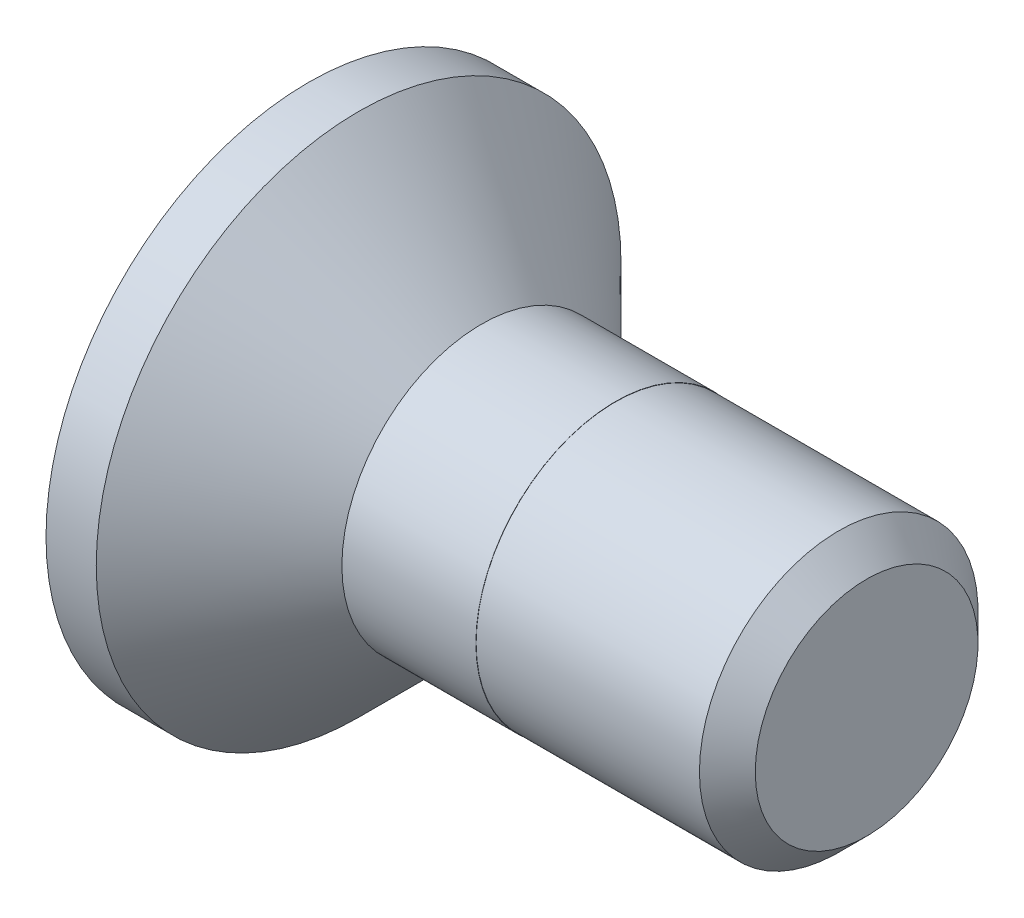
ISO-10303-21;
HEADER;
FILE_DESCRIPTION(('STEP AP214'),'2;1');
FILE_NAME('part.step','',(''),(''),'','','');
FILE_SCHEMA(('AUTOMOTIVE_DESIGN { 1 0 10303 214 1 1 1 1 }'));
ENDSEC;
DATA;
#1=APPLICATION_CONTEXT('core data for automotive mechanical design processes');
#2=APPLICATION_PROTOCOL_DEFINITION('international standard','automotive_design',2000,#1);
#3=PRODUCT_CONTEXT('',#1,'mechanical');
#4=PRODUCT('Part','Part','',(#3));
#5=PRODUCT_RELATED_PRODUCT_CATEGORY('part','',(#4));
#6=PRODUCT_DEFINITION_FORMATION('','',#4);
#7=PRODUCT_DEFINITION_CONTEXT('part definition',#1,'design');
#8=PRODUCT_DEFINITION('design','',#6,#7);
#9=PRODUCT_DEFINITION_SHAPE('','',#8);
#10=(LENGTH_UNIT() NAMED_UNIT(*) SI_UNIT(.MILLI.,.METRE.));
#11=(NAMED_UNIT(*) PLANE_ANGLE_UNIT() SI_UNIT($,.RADIAN.));
#12=(NAMED_UNIT(*) SI_UNIT($,.STERADIAN.) SOLID_ANGLE_UNIT());
#13=UNCERTAINTY_MEASURE_WITH_UNIT(LENGTH_MEASURE(1.E-05),#10,'distance_accuracy_value','');
#14=(GEOMETRIC_REPRESENTATION_CONTEXT(3) GLOBAL_UNCERTAINTY_ASSIGNED_CONTEXT((#13)) GLOBAL_UNIT_ASSIGNED_CONTEXT((#10,
#11,#12)) REPRESENTATION_CONTEXT('',''));
#15=CARTESIAN_POINT('',(0.,0.,0.));
#16=DIRECTION('',(0.,0.,1.));
#17=DIRECTION('',(1.,0.,0.));
#18=AXIS2_PLACEMENT_3D('',#15,#16,#17);
#19=CARTESIAN_POINT('',(0.,0.,0.));
#20=DIRECTION('',(-1.,0.,0.));
#21=DIRECTION('',(0.,0.,1.));
#22=AXIS2_PLACEMENT_3D('',#19,#20,#21);
#23=CYLINDRICAL_SURFACE('',#22,4.7);
#24=CARTESIAN_POINT('',(0.,0.,0.));
#25=DIRECTION('',(-1.,0.,0.));
#26=DIRECTION('',(0.,0.,1.));
#27=AXIS2_PLACEMENT_3D('',#24,#25,#26);
#28=CIRCLE('',#27,4.7);
#29=CARTESIAN_POINT('',(0.,0.,4.7));
#30=VERTEX_POINT('',#29);
#31=EDGE_CURVE('E146',#30,#30,#28,.T.);
#32=ORIENTED_EDGE('',*,*,#31,.F.);
#33=EDGE_LOOP('',(#32));
#34=FACE_BOUND('',#33,.T.);
#35=CARTESIAN_POINT('',(0.900000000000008,0.,0.));
#36=DIRECTION('',(-1.,0.,0.));
#37=DIRECTION('',(0.,0.,1.));
#38=AXIS2_PLACEMENT_3D('',#35,#36,#37);
#39=CIRCLE('',#38,4.7);
#40=CARTESIAN_POINT('',(0.900000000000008,0.,4.7));
#41=VERTEX_POINT('',#40);
#42=EDGE_CURVE('E182',#41,#41,#39,.T.);
#43=ORIENTED_EDGE('',*,*,#42,.T.);
#44=EDGE_LOOP('',(#43));
#45=FACE_BOUND('',#44,.T.);
#46=ADVANCED_FACE('F32',(#34,#45),#23,.T.);
#47=CARTESIAN_POINT('',(3.1,0.,0.));
#48=DIRECTION('',(-1.,0.,0.));
#49=DIRECTION('',(0.,0.,1.));
#50=AXIS2_PLACEMENT_3D('',#47,#48,#49);
#51=CONICAL_SURFACE('',#50,2.5,0.78539816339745);
#52=ORIENTED_EDGE('',*,*,#42,.F.);
#53=EDGE_LOOP('',(#52));
#54=FACE_BOUND('',#53,.T.);
#55=CARTESIAN_POINT('',(3.1,0.,0.));
#56=DIRECTION('',(-1.,0.,0.));
#57=DIRECTION('',(0.,0.,1.));
#58=AXIS2_PLACEMENT_3D('',#55,#56,#57);
#59=CIRCLE('',#58,2.5);
#60=CARTESIAN_POINT('',(3.1,0.,2.5));
#61=VERTEX_POINT('',#60);
#62=EDGE_CURVE('E179',#61,#61,#59,.T.);
#63=ORIENTED_EDGE('',*,*,#62,.T.);
#64=EDGE_LOOP('',(#63));
#65=FACE_BOUND('',#64,.T.);
#66=ADVANCED_FACE('F226',(#54,#65),#51,.T.);
#67=CARTESIAN_POINT('',(0.,0.,0.));
#68=DIRECTION('',(-1.,0.,0.));
#69=DIRECTION('',(0.,0.,1.));
#70=AXIS2_PLACEMENT_3D('',#67,#68,#69);
#71=CYLINDRICAL_SURFACE('',#70,2.5);
#72=ORIENTED_EDGE('',*,*,#62,.F.);
#73=EDGE_LOOP('',(#72));
#74=FACE_BOUND('',#73,.T.);
#75=CARTESIAN_POINT('',(5.5,0.,0.));
#76=DIRECTION('',(-1.,0.,0.));
#77=DIRECTION('',(0.,0.,1.));
#78=AXIS2_PLACEMENT_3D('',#75,#76,#77);
#79=CIRCLE('',#78,2.5);
#80=CARTESIAN_POINT('',(5.5,0.,2.5));
#81=VERTEX_POINT('',#80);
#82=EDGE_CURVE('E176',#81,#81,#79,.T.);
#83=ORIENTED_EDGE('',*,*,#82,.T.);
#84=EDGE_LOOP('',(#83));
#85=FACE_BOUND('',#84,.T.);
#86=ADVANCED_FACE('F231',(#74,#85),#71,.T.);
#87=CARTESIAN_POINT('',(5.5,2.5,0.));
#88=DIRECTION('',(-1.,0.,0.));
#89=DIRECTION('',(0.,0.,1.));
#90=AXIS2_PLACEMENT_3D('',#87,#88,#89);
#91=PLANE('',#90);
#92=ORIENTED_EDGE('',*,*,#82,.F.);
#93=EDGE_LOOP('',(#92));
#94=FACE_BOUND('',#93,.T.);
#95=CARTESIAN_POINT('',(5.5,0.,0.));
#96=DIRECTION('',(-1.,0.,0.));
#97=DIRECTION('',(0.,0.,1.));
#98=AXIS2_PLACEMENT_3D('',#95,#96,#97);
#99=CIRCLE('',#98,2.495);
#100=CARTESIAN_POINT('',(5.5,0.,2.495));
#101=VERTEX_POINT('',#100);
#102=EDGE_CURVE('E173',#101,#101,#99,.T.);
#103=ORIENTED_EDGE('',*,*,#102,.T.);
#104=EDGE_LOOP('',(#103));
#105=FACE_BOUND('',#104,.T.);
#106=ADVANCED_FACE('F241',(#94,#105),#91,.F.);
#107=CARTESIAN_POINT('',(0.,0.,0.));
#108=DIRECTION('',(-1.,0.,0.));
#109=DIRECTION('',(0.,0.,1.));
#110=AXIS2_PLACEMENT_3D('',#107,#108,#109);
#111=CYLINDRICAL_SURFACE('',#110,2.495);
#112=ORIENTED_EDGE('',*,*,#102,.F.);
#113=EDGE_LOOP('',(#112));
#114=FACE_BOUND('',#113,.T.);
#115=CARTESIAN_POINT('',(9.5,0.,0.));
#116=DIRECTION('',(-1.,0.,0.));
#117=DIRECTION('',(0.,0.,1.));
#118=AXIS2_PLACEMENT_3D('',#115,#116,#117);
#119=CIRCLE('',#118,2.495);
#120=CARTESIAN_POINT('',(9.5,0.,2.495));
#121=VERTEX_POINT('',#120);
#122=EDGE_CURVE('E170',#121,#121,#119,.T.);
#123=ORIENTED_EDGE('',*,*,#122,.T.);
#124=EDGE_LOOP('',(#123));
#125=FACE_BOUND('',#124,.T.);
#126=ADVANCED_FACE('F247',(#114,#125),#111,.T.);
#127=CARTESIAN_POINT('',(10.,0.,0.));
#128=DIRECTION('',(-1.,0.,0.));
#129=DIRECTION('',(0.,0.,1.));
#130=AXIS2_PLACEMENT_3D('',#127,#128,#129);
#131=CONICAL_SURFACE('',#130,1.995,0.78539816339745);
#132=ORIENTED_EDGE('',*,*,#122,.F.);
#133=EDGE_LOOP('',(#132));
#134=FACE_BOUND('',#133,.T.);
#135=CARTESIAN_POINT('',(10.,0.,0.));
#136=DIRECTION('',(-1.,0.,0.));
#137=DIRECTION('',(0.,0.,1.));
#138=AXIS2_PLACEMENT_3D('',#135,#136,#137);
#139=CIRCLE('',#138,1.995);
#140=CARTESIAN_POINT('',(10.,0.,1.995));
#141=VERTEX_POINT('',#140);
#142=EDGE_CURVE('E166',#141,#141,#139,.T.);
#143=ORIENTED_EDGE('',*,*,#142,.T.);
#144=EDGE_LOOP('',(#143));
#145=FACE_BOUND('',#144,.T.);
#146=ADVANCED_FACE('F253',(#134,#145),#131,.T.);
#147=CARTESIAN_POINT('',(10.,1.995,0.));
#148=DIRECTION('',(-1.,0.,0.));
#149=DIRECTION('',(0.,0.,1.));
#150=AXIS2_PLACEMENT_3D('',#147,#148,#149);
#151=PLANE('',#150);
#152=ORIENTED_EDGE('',*,*,#142,.F.);
#153=EDGE_LOOP('',(#152));
#154=FACE_BOUND('',#153,.T.);
#155=ADVANCED_FACE('F221',(#154),#151,.F.);
#156=CARTESIAN_POINT('',(0.,0.,0.));
#157=DIRECTION('',(-1.,0.,0.));
#158=DIRECTION('',(0.,0.,1.));
#159=AXIS2_PLACEMENT_3D('',#156,#157,#158);
#160=CONICAL_SURFACE('',#159,2.,1.03037682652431);
#161=CARTESIAN_POINT('',(0.160700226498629,1.5002,0.865909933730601));
#162=CARTESIAN_POINT('',(0.183625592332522,1.43405085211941,0.904101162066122));
#163=CARTESIAN_POINT('',(0.204484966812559,1.36728500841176,0.942648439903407));
#164=CARTESIAN_POINT('',(0.240886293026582,1.23250047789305,1.02046632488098));
#165=CARTESIAN_POINT('',(0.256414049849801,1.16447894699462,1.05973857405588));
#166=CARTESIAN_POINT('',(0.280505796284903,1.02934707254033,1.13775699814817));
#167=CARTESIAN_POINT('',(0.28924498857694,0.962261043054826,1.17648913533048));
#168=CARTESIAN_POINT('',(0.299575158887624,0.827755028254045,1.25414621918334));
#169=CARTESIAN_POINT('',(0.301175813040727,0.760335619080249,1.29307083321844));
#170=CARTESIAN_POINT('',(0.297373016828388,0.634924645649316,1.36547689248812));
#171=CARTESIAN_POINT('',(0.292901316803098,0.57690994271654,1.39897169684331));
#172=CARTESIAN_POINT('',(0.278885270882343,0.461290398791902,1.46572467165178));
#173=CARTESIAN_POINT('',(0.269335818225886,0.403686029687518,1.4989825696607));
#174=CARTESIAN_POINT('',(0.245522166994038,0.287815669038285,1.56588035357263));
#175=CARTESIAN_POINT('',(0.231151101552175,0.229566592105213,1.59951047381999));
#176=CARTESIAN_POINT('',(0.198589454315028,0.114000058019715,1.66623284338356));
#177=CARTESIAN_POINT('',(0.180407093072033,0.0566808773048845,1.699326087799));
#178=CARTESIAN_POINT('',(0.160700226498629,-0.000199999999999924,1.73216627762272));
#179=B_SPLINE_CURVE_WITH_KNOTS('',3,(#161,#162,#163,#164,#165,#166,#167,#168,#169,#170,#171,
#172,#173,#174,#175,#176,#177,#178),.UNSPECIFIED.,.F.,.F.,(4,2,2,2,2,2,2,2,4),(0.,
0.23935133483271,0.479335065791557,0.712897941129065,0.946144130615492,1.14735633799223,
1.34877129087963,1.55498299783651,1.76075442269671),.UNSPECIFIED.);
#180=CARTESIAN_POINT('',(0.160769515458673,1.5,0.866025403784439));
#181=VERTEX_POINT('',#180);
#182=CARTESIAN_POINT('',(0.160769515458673,0.,1.73205080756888));
#183=VERTEX_POINT('',#182);
#184=EDGE_CURVE('E185',#181,#183,#179,.T.);
#185=ORIENTED_EDGE('',*,*,#184,.T.);
#186=CARTESIAN_POINT('',(0.160700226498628,0.000200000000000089,1.73216627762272));
#187=CARTESIAN_POINT('',(0.183625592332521,-0.0659491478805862,1.6939750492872));
#188=CARTESIAN_POINT('',(0.204484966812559,-0.132714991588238,1.65542777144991));
#189=CARTESIAN_POINT('',(0.240886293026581,-0.267499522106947,1.57760988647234));
#190=CARTESIAN_POINT('',(0.256414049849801,-0.335521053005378,1.53833763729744));
#191=CARTESIAN_POINT('',(0.280505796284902,-0.470652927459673,1.46031921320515));
#192=CARTESIAN_POINT('',(0.289244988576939,-0.537738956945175,1.42158707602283));
#193=CARTESIAN_POINT('',(0.299575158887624,-0.672244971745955,1.34392999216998));
#194=CARTESIAN_POINT('',(0.301175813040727,-0.739664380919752,1.30500537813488));
#195=CARTESIAN_POINT('',(0.297373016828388,-0.865075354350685,1.2325993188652));
#196=CARTESIAN_POINT('',(0.292901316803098,-0.92309005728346,1.19910451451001));
#197=CARTESIAN_POINT('',(0.278885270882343,-1.0387096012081,1.13235153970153));
#198=CARTESIAN_POINT('',(0.269335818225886,-1.09631397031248,1.09909364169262));
#199=CARTESIAN_POINT('',(0.245522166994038,-1.21218433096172,1.03219585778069));
#200=CARTESIAN_POINT('',(0.231151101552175,-1.27043340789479,0.99856573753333));
#201=CARTESIAN_POINT('',(0.198589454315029,-1.38599994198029,0.931843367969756));
#202=CARTESIAN_POINT('',(0.180407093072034,-1.44331912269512,0.89875012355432));
#203=CARTESIAN_POINT('',(0.160700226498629,-1.5002,0.865909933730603));
#204=B_SPLINE_CURVE_WITH_KNOTS('',3,(#186,#187,#188,#189,#190,#191,#192,#193,#194,#195,#196,
#197,#198,#199,#200,#201,#202,#203),.UNSPECIFIED.,.F.,.F.,(4,2,2,2,2,2,2,2,4),(0.,
0.23935133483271,0.479335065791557,0.712897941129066,0.946144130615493,1.14735633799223,
1.34877129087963,1.55498299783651,1.76075442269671),.UNSPECIFIED.);
#205=CARTESIAN_POINT('',(0.160769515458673,-1.5,0.866025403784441));
#206=VERTEX_POINT('',#205);
#207=EDGE_CURVE('E11',#183,#206,#204,.T.);
#208=ORIENTED_EDGE('',*,*,#207,.T.);
#209=CARTESIAN_POINT('',(-0.45745973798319,-1.5,-2.31970590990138));
#210=CARTESIAN_POINT('',(-0.424612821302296,-1.5,-2.25449475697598));
#211=CARTESIAN_POINT('',(-0.392076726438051,-1.5,-2.18912430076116));
#212=CARTESIAN_POINT('',(-0.327801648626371,-1.5,-2.05797964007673));
#213=CARTESIAN_POINT('',(-0.296062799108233,-1.5,-1.99220537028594));
#214=CARTESIAN_POINT('',(-0.233385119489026,-1.5,-1.85980172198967));
#215=CARTESIAN_POINT('',(-0.20245208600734,-1.5,-1.7931695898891));
#216=CARTESIAN_POINT('',(-0.141839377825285,-1.5,-1.65933981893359));
#217=CARTESIAN_POINT('',(-0.112159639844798,-1.5,-1.59214220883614));
#218=CARTESIAN_POINT('',(-0.0533895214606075,-1.5,-1.45473392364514));
#219=CARTESIAN_POINT('',(-0.0243548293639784,-1.5,-1.38449929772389));
#220=CARTESIAN_POINT('',(0.0315259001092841,-1.5,-1.24314766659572));
#221=CARTESIAN_POINT('',(0.0583716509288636,-1.5,-1.17203054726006));
#222=CARTESIAN_POINT('',(0.109155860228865,-1.5,-1.0289373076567));
#223=CARTESIAN_POINT('',(0.133100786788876,-1.5,-0.956963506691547));
#224=CARTESIAN_POINT('',(0.177307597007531,-1.5,-0.811897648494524));
#225=CARTESIAN_POINT('',(0.197570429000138,-1.5,-0.738805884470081));
#226=CARTESIAN_POINT('',(0.233301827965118,-1.5,-0.591883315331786));
#227=CARTESIAN_POINT('',(0.248797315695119,-1.5,-0.518059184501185));
#228=CARTESIAN_POINT('',(0.274091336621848,-1.5,-0.369426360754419));
#229=CARTESIAN_POINT('',(0.283890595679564,-1.5,-0.294617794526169));
#230=CARTESIAN_POINT('',(0.296845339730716,-1.5,-0.145464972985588));
#231=CARTESIAN_POINT('',(0.30009182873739,-1.5,-0.0711288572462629));
#232=CARTESIAN_POINT('',(0.299904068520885,-1.5,0.0775341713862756));
#233=CARTESIAN_POINT('',(0.296469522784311,-1.5,0.151861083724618));
#234=CARTESIAN_POINT('',(0.280948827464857,-1.5,0.325486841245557));
#235=CARTESIAN_POINT('',(0.266286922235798,-1.5,0.424555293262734));
#236=CARTESIAN_POINT('',(0.227558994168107,-1.5,0.620835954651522));
#237=CARTESIAN_POINT('',(0.203484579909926,-1.5,0.718046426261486));
#238=CARTESIAN_POINT('',(0.147795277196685,-1.5,0.912610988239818));
#239=CARTESIAN_POINT('',(0.116022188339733,-1.5,1.00991861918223));
#240=CARTESIAN_POINT('',(0.0473792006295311,-1.5,1.20265488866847));
#241=CARTESIAN_POINT('',(0.0105105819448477,-1.5,1.29808399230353));
#242=CARTESIAN_POINT('',(-0.0817728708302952,-1.5,1.52415211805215));
#243=CARTESIAN_POINT('',(-0.138839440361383,-1.5,1.65411007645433));
#244=CARTESIAN_POINT('',(-0.257286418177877,-1.5,1.91205803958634));
#245=CARTESIAN_POINT('',(-0.318668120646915,-1.5,2.04004743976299));
#246=CARTESIAN_POINT('',(-0.444338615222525,-1.5,2.29476371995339));
#247=CARTESIAN_POINT('',(-0.508630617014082,-1.5,2.42148900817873));
#248=CARTESIAN_POINT('',(-0.639158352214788,-1.5,2.67393556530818));
#249=CARTESIAN_POINT('',(-0.705394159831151,-1.5,2.79965679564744));
#250=CARTESIAN_POINT('',(-0.833469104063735,-1.5,3.03954339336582));
#251=CARTESIAN_POINT('',(-0.895194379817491,-1.5,3.15376971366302));
#252=CARTESIAN_POINT('',(-1.0195134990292,-1.5,3.38175374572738));
#253=CARTESIAN_POINT('',(-1.08210737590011,-1.5,3.4955114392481));
#254=CARTESIAN_POINT('',(-1.2077848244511,-1.5,3.72234620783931));
#255=CARTESIAN_POINT('',(-1.27086657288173,-1.5,3.83542429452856));
#256=CARTESIAN_POINT('',(-1.39755082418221,-1.5,4.06127946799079));
#257=CARTESIAN_POINT('',(-1.46115329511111,-1.5,4.1740565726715));
#258=CARTESIAN_POINT('',(-1.52495068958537,-1.5,4.28672247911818));
#259=B_SPLINE_CURVE_WITH_KNOTS('',3,(#209,#210,#211,#212,#213,#214,#215,#216,#217,#218,#219,
#220,#221,#222,#223,#224,#225,#226,#227,#228,#229,#230,#231,#232,#233,#234,#235,#236,#237,#238,
#239,#240,#241,#242,#243,#244,#245,#246,#247,#248,#249,#250,#251,#252,#253,#254,#255,#256,#257,
#258),.UNSPECIFIED.,.F.,.F.,(4,2,2,2,2,2,2,2,2,2,2,2,2,2,2,2,2,2,2,2,2,2,2,2,4),(0.,
0.219052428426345,0.438141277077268,0.658517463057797,0.878882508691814,1.1068525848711,
1.33485245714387,1.56233420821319,1.78975728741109,2.01587150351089,2.24195689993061,
2.46488023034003,2.68781345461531,2.98764973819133,3.28775394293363,3.59464431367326,
3.90145772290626,4.32712672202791,4.75292393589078,5.17920277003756,5.60549789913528,
5.99500437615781,6.38452587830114,6.77297469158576,7.16139985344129),.UNSPECIFIED.);
#260=CARTESIAN_POINT('',(0.160769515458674,-1.5,-0.866025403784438));
#261=VERTEX_POINT('',#260);
#262=EDGE_CURVE('E44',#206,#261,#259,.F.);
#263=ORIENTED_EDGE('',*,*,#262,.T.);
#264=CARTESIAN_POINT('',(0.16070022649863,-1.5002,-0.8659099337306));
#265=CARTESIAN_POINT('',(0.183625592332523,-1.43405085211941,-0.904101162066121));
#266=CARTESIAN_POINT('',(0.20448496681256,-1.36728500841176,-0.942648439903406));
#267=CARTESIAN_POINT('',(0.240886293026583,-1.23250047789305,-1.02046632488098));
#268=CARTESIAN_POINT('',(0.256414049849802,-1.16447894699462,-1.05973857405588));
#269=CARTESIAN_POINT('',(0.280505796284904,-1.02934707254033,-1.13775699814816));
#270=CARTESIAN_POINT('',(0.289244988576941,-0.962261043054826,-1.17648913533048));
#271=CARTESIAN_POINT('',(0.299575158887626,-0.827755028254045,-1.25414621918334));
#272=CARTESIAN_POINT('',(0.301175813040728,-0.760335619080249,-1.29307083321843));
#273=CARTESIAN_POINT('',(0.297373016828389,-0.634924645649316,-1.36547689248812));
#274=CARTESIAN_POINT('',(0.2929013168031,-0.57690994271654,-1.39897169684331));
#275=CARTESIAN_POINT('',(0.278885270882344,-0.461290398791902,-1.46572467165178));
#276=CARTESIAN_POINT('',(0.269335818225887,-0.403686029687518,-1.4989825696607));
#277=CARTESIAN_POINT('',(0.24552216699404,-0.287815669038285,-1.56588035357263));
#278=CARTESIAN_POINT('',(0.231151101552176,-0.229566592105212,-1.59951047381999));
#279=CARTESIAN_POINT('',(0.198589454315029,-0.114000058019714,-1.66623284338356));
#280=CARTESIAN_POINT('',(0.180407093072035,-0.0566808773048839,-1.699326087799));
#281=CARTESIAN_POINT('',(0.16070022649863,0.000200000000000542,-1.73216627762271));
#282=B_SPLINE_CURVE_WITH_KNOTS('',3,(#264,#265,#266,#267,#268,#269,#270,#271,#272,#273,#274,
#275,#276,#277,#278,#279,#280,#281),.UNSPECIFIED.,.F.,.F.,(4,2,2,2,2,2,2,2,4),(0.,
0.23935133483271,0.479335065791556,0.712897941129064,0.946144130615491,1.14735633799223,
1.34877129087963,1.55498299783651,1.76075442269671),.UNSPECIFIED.);
#283=CARTESIAN_POINT('',(0.160769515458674,0.,-1.73205080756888));
#284=VERTEX_POINT('',#283);
#285=EDGE_CURVE('E299',#261,#284,#282,.T.);
#286=ORIENTED_EDGE('',*,*,#285,.T.);
#287=CARTESIAN_POINT('',(0.16070022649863,-0.000199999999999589,-1.73216627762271));
#288=CARTESIAN_POINT('',(0.183625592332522,0.0659491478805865,-1.69397504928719));
#289=CARTESIAN_POINT('',(0.20448496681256,0.132714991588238,-1.65542777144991));
#290=CARTESIAN_POINT('',(0.240886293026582,0.267499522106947,-1.57760988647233));
#291=CARTESIAN_POINT('',(0.256414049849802,0.335521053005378,-1.53833763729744));
#292=CARTESIAN_POINT('',(0.280505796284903,0.470652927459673,-1.46031921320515));
#293=CARTESIAN_POINT('',(0.289244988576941,0.537738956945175,-1.42158707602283));
#294=CARTESIAN_POINT('',(0.299575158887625,0.672244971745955,-1.34392999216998));
#295=CARTESIAN_POINT('',(0.301175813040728,0.739664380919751,-1.30500537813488));
#296=CARTESIAN_POINT('',(0.297373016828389,0.865075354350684,-1.2325993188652));
#297=CARTESIAN_POINT('',(0.292901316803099,0.92309005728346,-1.19910451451));
#298=CARTESIAN_POINT('',(0.278885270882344,1.0387096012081,-1.13235153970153));
#299=CARTESIAN_POINT('',(0.269335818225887,1.09631397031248,-1.09909364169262));
#300=CARTESIAN_POINT('',(0.245522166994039,1.21218433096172,-1.03219585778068));
#301=CARTESIAN_POINT('',(0.231151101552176,1.27043340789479,-0.998565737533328));
#302=CARTESIAN_POINT('',(0.198589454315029,1.38599994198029,-0.931843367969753));
#303=CARTESIAN_POINT('',(0.180407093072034,1.44331912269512,-0.898750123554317));
#304=CARTESIAN_POINT('',(0.16070022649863,1.5002,-0.8659099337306));
#305=B_SPLINE_CURVE_WITH_KNOTS('',3,(#287,#288,#289,#290,#291,#292,#293,#294,#295,#296,#297,
#298,#299,#300,#301,#302,#303,#304),.UNSPECIFIED.,.F.,.F.,(4,2,2,2,2,2,2,2,4),(0.,
0.23935133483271,0.479335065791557,0.712897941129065,0.946144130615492,1.14735633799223,
1.34877129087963,1.55498299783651,1.76075442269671),.UNSPECIFIED.);
#306=CARTESIAN_POINT('',(0.160769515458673,1.5,-0.866025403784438));
#307=VERTEX_POINT('',#306);
#308=EDGE_CURVE('E303',#284,#307,#305,.T.);
#309=ORIENTED_EDGE('',*,*,#308,.T.);
#310=CARTESIAN_POINT('',(-0.457459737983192,1.5,-2.31970590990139));
#311=CARTESIAN_POINT('',(-0.424612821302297,1.5,-2.25449475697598));
#312=CARTESIAN_POINT('',(-0.392076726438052,1.5,-2.18912430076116));
#313=CARTESIAN_POINT('',(-0.327801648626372,1.5,-2.05797964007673));
#314=CARTESIAN_POINT('',(-0.296062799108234,1.5,-1.99220537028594));
#315=CARTESIAN_POINT('',(-0.233385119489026,1.5,-1.85980172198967));
#316=CARTESIAN_POINT('',(-0.20245208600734,1.5,-1.7931695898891));
#317=CARTESIAN_POINT('',(-0.141839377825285,1.5,-1.65933981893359));
#318=CARTESIAN_POINT('',(-0.112159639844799,1.5,-1.59214220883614));
#319=CARTESIAN_POINT('',(-0.0533895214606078,1.5,-1.45473392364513));
#320=CARTESIAN_POINT('',(-0.0243548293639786,1.5,-1.38449929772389));
#321=CARTESIAN_POINT('',(0.0315259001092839,1.5,-1.24314766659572));
#322=CARTESIAN_POINT('',(0.0583716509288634,1.5,-1.17203054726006));
#323=CARTESIAN_POINT('',(0.109155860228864,1.5,-1.0289373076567));
#324=CARTESIAN_POINT('',(0.133100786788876,1.5,-0.956963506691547));
#325=CARTESIAN_POINT('',(0.17730759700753,1.5,-0.811897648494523));
#326=CARTESIAN_POINT('',(0.197570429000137,1.5,-0.73880588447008));
#327=CARTESIAN_POINT('',(0.233301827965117,1.5,-0.591883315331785));
#328=CARTESIAN_POINT('',(0.248797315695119,1.5,-0.518059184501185));
#329=CARTESIAN_POINT('',(0.274091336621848,1.5,-0.369426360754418));
#330=CARTESIAN_POINT('',(0.283890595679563,1.5,-0.294617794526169));
#331=CARTESIAN_POINT('',(0.296845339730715,1.5,-0.145464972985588));
#332=CARTESIAN_POINT('',(0.30009182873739,1.5,-0.0711288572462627));
#333=CARTESIAN_POINT('',(0.299904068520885,1.5,0.0775341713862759));
#334=CARTESIAN_POINT('',(0.296469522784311,1.5,0.151861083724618));
#335=CARTESIAN_POINT('',(0.280948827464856,1.5,0.325486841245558));
#336=CARTESIAN_POINT('',(0.266286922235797,1.5,0.424555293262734));
#337=CARTESIAN_POINT('',(0.227558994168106,1.5,0.620835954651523));
#338=CARTESIAN_POINT('',(0.203484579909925,1.5,0.718046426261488));
#339=CARTESIAN_POINT('',(0.147795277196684,1.5,0.912610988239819));
#340=CARTESIAN_POINT('',(0.116022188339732,1.5,1.00991861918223));
#341=CARTESIAN_POINT('',(0.0473792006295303,1.5,1.20265488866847));
#342=CARTESIAN_POINT('',(0.0105105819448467,1.5,1.29808399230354));
#343=CARTESIAN_POINT('',(-0.0817728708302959,1.5,1.52415211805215));
#344=CARTESIAN_POINT('',(-0.138839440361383,1.5,1.65411007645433));
#345=CARTESIAN_POINT('',(-0.257286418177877,1.5,1.91205803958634));
#346=CARTESIAN_POINT('',(-0.318668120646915,1.5,2.04004743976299));
#347=CARTESIAN_POINT('',(-0.444338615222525,1.5,2.29476371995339));
#348=CARTESIAN_POINT('',(-0.508630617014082,1.5,2.42148900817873));
#349=CARTESIAN_POINT('',(-0.639158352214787,1.5,2.67393556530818));
#350=CARTESIAN_POINT('',(-0.70539415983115,1.5,2.79965679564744));
#351=CARTESIAN_POINT('',(-0.833469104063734,1.5,3.03954339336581));
#352=CARTESIAN_POINT('',(-0.89519437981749,1.5,3.15376971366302));
#353=CARTESIAN_POINT('',(-1.0195134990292,1.5,3.38175374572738));
#354=CARTESIAN_POINT('',(-1.08210737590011,1.5,3.4955114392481));
#355=CARTESIAN_POINT('',(-1.2077848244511,1.5,3.72234620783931));
#356=CARTESIAN_POINT('',(-1.27086657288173,1.5,3.83542429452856));
#357=CARTESIAN_POINT('',(-1.39755082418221,1.5,4.06127946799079));
#358=CARTESIAN_POINT('',(-1.46115329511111,1.5,4.1740565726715));
#359=CARTESIAN_POINT('',(-1.52495068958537,1.5,4.28672247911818));
#360=B_SPLINE_CURVE_WITH_KNOTS('',3,(#310,#311,#312,#313,#314,#315,#316,#317,#318,#319,#320,
#321,#322,#323,#324,#325,#326,#327,#328,#329,#330,#331,#332,#333,#334,#335,#336,#337,#338,#339,
#340,#341,#342,#343,#344,#345,#346,#347,#348,#349,#350,#351,#352,#353,#354,#355,#356,#357,#358,
#359),.UNSPECIFIED.,.F.,.F.,(4,2,2,2,2,2,2,2,2,2,2,2,2,2,2,2,2,2,2,2,2,2,2,2,4),(0.,
0.219052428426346,0.438141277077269,0.658517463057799,0.878882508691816,1.10685258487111,
1.33485245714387,1.5623342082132,1.78975728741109,2.0158715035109,2.24195689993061,
2.46488023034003,2.68781345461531,2.98764973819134,3.28775394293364,3.59464431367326,
3.90145772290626,4.32712672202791,4.75292393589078,5.17920277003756,5.60549789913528,
5.99500437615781,6.38452587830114,6.77297469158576,7.16139985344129),.UNSPECIFIED.);
#361=EDGE_CURVE('E191',#307,#181,#360,.T.);
#362=ORIENTED_EDGE('',*,*,#361,.T.);
#363=EDGE_LOOP('',(#185,#208,#263,#286,#309,#362));
#364=FACE_BOUND('',#363,.T.);
#365=CARTESIAN_POINT('',(0.,0.,0.));
#366=DIRECTION('',(-1.,0.,0.));
#367=DIRECTION('',(0.,0.,1.));
#368=AXIS2_PLACEMENT_3D('',#365,#366,#367);
#369=CIRCLE('',#368,2.);
#370=CARTESIAN_POINT('',(0.,0.,2.));
#371=VERTEX_POINT('',#370);
#372=EDGE_CURVE('E160',#371,#371,#369,.T.);
#373=ORIENTED_EDGE('',*,*,#372,.T.);
#374=EDGE_LOOP('',(#373));
#375=FACE_BOUND('',#374,.T.);
#376=ADVANCED_FACE('F197',(#364,#375),#160,.F.);
#377=CARTESIAN_POINT('',(0.,2.,0.));
#378=DIRECTION('',(1.,0.,0.));
#379=DIRECTION('',(0.,0.,-1.));
#380=AXIS2_PLACEMENT_3D('',#377,#378,#379);
#381=PLANE('',#380);
#382=ORIENTED_EDGE('',*,*,#372,.F.);
#383=EDGE_LOOP('',(#382));
#384=FACE_BOUND('',#383,.T.);
#385=ORIENTED_EDGE('',*,*,#31,.T.);
#386=EDGE_LOOP('',(#385));
#387=FACE_BOUND('',#386,.T.);
#388=ADVANCED_FACE('F210',(#384,#387),#381,.F.);
#389=CARTESIAN_POINT('',(2.1,0.,1.73205080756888));
#390=DIRECTION('',(-1.,0.,0.));
#391=DIRECTION('',(0.,0.,1.));
#392=AXIS2_PLACEMENT_3D('',#389,#390,#391);
#393=PLANE('',#392);
#394=CARTESIAN_POINT('',(2.1,0.,0.));
#395=DIRECTION('',(-1.,0.,0.));
#396=DIRECTION('',(0.,0.,1.));
#397=AXIS2_PLACEMENT_3D('',#394,#395,#396);
#398=CIRCLE('',#397,1.5);
#399=CARTESIAN_POINT('',(2.1,-1.5,0.));
#400=VERTEX_POINT('',#399);
#401=CARTESIAN_POINT('',(2.1,-0.750000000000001,1.29903810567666));
#402=VERTEX_POINT('',#401);
#403=EDGE_CURVE('E287',#400,#402,#398,.T.);
#404=ORIENTED_EDGE('',*,*,#403,.F.);
#405=DIRECTION('',(0.,0.,1.));
#406=VECTOR('',#405,1.);
#407=CARTESIAN_POINT('',(2.1,-1.5,-0.866025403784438));
#408=LINE('',#407,#406);
#409=CARTESIAN_POINT('',(2.1,-1.5,0.866025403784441));
#410=VERTEX_POINT('',#409);
#411=EDGE_CURVE('E141',#400,#410,#408,.T.);
#412=ORIENTED_EDGE('',*,*,#411,.T.);
#413=DIRECTION('',(0.,0.866025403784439,0.5));
#414=VECTOR('',#413,1.);
#415=CARTESIAN_POINT('',(2.1,-1.5,0.866025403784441));
#416=LINE('',#415,#414);
#417=EDGE_CURVE('E114',#410,#402,#416,.T.);
#418=ORIENTED_EDGE('',*,*,#417,.T.);
#419=EDGE_LOOP('',(#404,#412,#418));
#420=FACE_BOUND('',#419,.T.);
#421=ADVANCED_FACE('F212',(#420),#393,.T.);
#422=CARTESIAN_POINT('',(2.1,-0.75,-1.29903810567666));
#423=VERTEX_POINT('',#422);
#424=EDGE_CURVE('E285',#423,#400,#398,.T.);
#425=ORIENTED_EDGE('',*,*,#424,.F.);
#426=DIRECTION('',(0.,-0.866025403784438,0.5));
#427=VECTOR('',#426,1.);
#428=CARTESIAN_POINT('',(2.1,0.,-1.73205080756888));
#429=LINE('',#428,#427);
#430=CARTESIAN_POINT('',(2.1,-1.5,-0.866025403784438));
#431=VERTEX_POINT('',#430);
#432=EDGE_CURVE('E137',#423,#431,#429,.T.);
#433=ORIENTED_EDGE('',*,*,#432,.T.);
#434=EDGE_CURVE('E121',#431,#400,#408,.T.);
#435=ORIENTED_EDGE('',*,*,#434,.T.);
#436=EDGE_LOOP('',(#425,#433,#435));
#437=FACE_BOUND('',#436,.T.);
#438=ADVANCED_FACE('F218',(#437),#393,.T.);
#439=CARTESIAN_POINT('',(2.1,0.75,-1.29903810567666));
#440=VERTEX_POINT('',#439);
#441=EDGE_CURVE('E284',#440,#423,#398,.T.);
#442=ORIENTED_EDGE('',*,*,#441,.F.);
#443=DIRECTION('',(0.,-0.866025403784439,-0.5));
#444=VECTOR('',#443,1.);
#445=CARTESIAN_POINT('',(2.1,1.5,-0.866025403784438));
#446=LINE('',#445,#444);
#447=CARTESIAN_POINT('',(2.1,0.,-1.73205080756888));
#448=VERTEX_POINT('',#447);
#449=EDGE_CURVE('E133',#440,#448,#446,.T.);
#450=ORIENTED_EDGE('',*,*,#449,.T.);
#451=EDGE_CURVE('E138',#448,#423,#429,.T.);
#452=ORIENTED_EDGE('',*,*,#451,.T.);
#453=EDGE_LOOP('',(#442,#450,#452));
#454=FACE_BOUND('',#453,.T.);
#455=ADVANCED_FACE('F327',(#454),#393,.T.);
#456=CARTESIAN_POINT('',(2.1,1.5,0.));
#457=VERTEX_POINT('',#456);
#458=EDGE_CURVE('E167',#457,#440,#398,.T.);
#459=ORIENTED_EDGE('',*,*,#458,.F.);
#460=DIRECTION('',(0.,0.,-1.));
#461=VECTOR('',#460,1.);
#462=CARTESIAN_POINT('',(2.1,1.5,0.866025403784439));
#463=LINE('',#462,#461);
#464=CARTESIAN_POINT('',(2.1,1.5,-0.866025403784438));
#465=VERTEX_POINT('',#464);
#466=EDGE_CURVE('E127',#457,#465,#463,.T.);
#467=ORIENTED_EDGE('',*,*,#466,.T.);
#468=EDGE_CURVE('E134',#465,#440,#446,.T.);
#469=ORIENTED_EDGE('',*,*,#468,.T.);
#470=EDGE_LOOP('',(#459,#467,#469));
#471=FACE_BOUND('',#470,.T.);
#472=ADVANCED_FACE('F283',(#471),#393,.T.);
#473=CARTESIAN_POINT('',(2.1,0.75,1.29903810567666));
#474=VERTEX_POINT('',#473);
#475=EDGE_CURVE('E163',#474,#457,#398,.T.);
#476=ORIENTED_EDGE('',*,*,#475,.F.);
#477=DIRECTION('',(0.,0.866025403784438,-0.5));
#478=VECTOR('',#477,1.);
#479=CARTESIAN_POINT('',(2.1,0.,1.73205080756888));
#480=LINE('',#479,#478);
#481=CARTESIAN_POINT('',(2.1,1.5,0.866025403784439));
#482=VERTEX_POINT('',#481);
#483=EDGE_CURVE('E125',#474,#482,#480,.T.);
#484=ORIENTED_EDGE('',*,*,#483,.T.);
#485=EDGE_CURVE('E129',#482,#457,#463,.T.);
#486=ORIENTED_EDGE('',*,*,#485,.T.);
#487=EDGE_LOOP('',(#476,#484,#486));
#488=FACE_BOUND('',#487,.T.);
#489=ADVANCED_FACE('F275',(#488),#393,.T.);
#490=EDGE_CURVE('E111',#402,#474,#398,.T.);
#491=ORIENTED_EDGE('',*,*,#490,.F.);
#492=CARTESIAN_POINT('',(2.1,0.,1.73205080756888));
#493=VERTEX_POINT('',#492);
#494=EDGE_CURVE('E108',#402,#493,#416,.T.);
#495=ORIENTED_EDGE('',*,*,#494,.T.);
#496=EDGE_CURVE('E51',#493,#474,#480,.T.);
#497=ORIENTED_EDGE('',*,*,#496,.T.);
#498=EDGE_LOOP('',(#491,#495,#497));
#499=FACE_BOUND('',#498,.T.);
#500=ADVANCED_FACE('F109',(#499),#393,.T.);
#501=CARTESIAN_POINT('',(2.1,-1.5,0.866025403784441));
#502=DIRECTION('',(0.,-0.5,0.866025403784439));
#503=DIRECTION('',(0.,-0.866025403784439,-0.5));
#504=AXIS2_PLACEMENT_3D('',#501,#502,#503);
#505=PLANE('',#504);
#506=ORIENTED_EDGE('',*,*,#207,.F.);
#507=DIRECTION('',(-1.,0.,0.));
#508=VECTOR('',#507,1.);
#509=CARTESIAN_POINT('',(2.1,0.,1.73205080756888));
#510=LINE('',#509,#508);
#511=EDGE_CURVE('E116',#493,#183,#510,.T.);
#512=ORIENTED_EDGE('',*,*,#511,.F.);
#513=ORIENTED_EDGE('',*,*,#494,.F.);
#514=ORIENTED_EDGE('',*,*,#417,.F.);
#515=DIRECTION('',(-1.,0.,0.));
#516=VECTOR('',#515,1.);
#517=CARTESIAN_POINT('',(2.1,-1.5,0.866025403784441));
#518=LINE('',#517,#516);
#519=EDGE_CURVE('E144',#410,#206,#518,.T.);
#520=ORIENTED_EDGE('',*,*,#519,.T.);
#521=EDGE_LOOP('',(#506,#512,#513,#514,#520));
#522=FACE_BOUND('',#521,.T.);
#523=ADVANCED_FACE('F117',(#522),#505,.F.);
#524=CARTESIAN_POINT('',(2.1,-1.5,-0.866025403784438));
#525=DIRECTION('',(0.,-1.,0.));
#526=DIRECTION('',(0.,0.,-1.));
#527=AXIS2_PLACEMENT_3D('',#524,#525,#526);
#528=PLANE('',#527);
#529=ORIENTED_EDGE('',*,*,#262,.F.);
#530=ORIENTED_EDGE('',*,*,#519,.F.);
#531=ORIENTED_EDGE('',*,*,#411,.F.);
#532=ORIENTED_EDGE('',*,*,#434,.F.);
#533=DIRECTION('',(-1.,0.,0.));
#534=VECTOR('',#533,1.);
#535=CARTESIAN_POINT('',(2.1,-1.5,-0.866025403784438));
#536=LINE('',#535,#534);
#537=EDGE_CURVE('E147',#431,#261,#536,.T.);
#538=ORIENTED_EDGE('',*,*,#537,.T.);
#539=EDGE_LOOP('',(#529,#530,#531,#532,#538));
#540=FACE_BOUND('',#539,.T.);
#541=ADVANCED_FACE('F209',(#540),#528,.F.);
#542=CARTESIAN_POINT('',(2.1,0.,-1.73205080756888));
#543=DIRECTION('',(0.,-0.5,-0.866025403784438));
#544=DIRECTION('',(0.,0.866025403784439,-0.5));
#545=AXIS2_PLACEMENT_3D('',#542,#543,#544);
#546=PLANE('',#545);
#547=ORIENTED_EDGE('',*,*,#285,.F.);
#548=ORIENTED_EDGE('',*,*,#537,.F.);
#549=ORIENTED_EDGE('',*,*,#432,.F.);
#550=ORIENTED_EDGE('',*,*,#451,.F.);
#551=DIRECTION('',(-1.,0.,0.));
#552=VECTOR('',#551,1.);
#553=CARTESIAN_POINT('',(2.1,0.,-1.73205080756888));
#554=LINE('',#553,#552);
#555=EDGE_CURVE('E150',#448,#284,#554,.T.);
#556=ORIENTED_EDGE('',*,*,#555,.T.);
#557=EDGE_LOOP('',(#547,#548,#549,#550,#556));
#558=FACE_BOUND('',#557,.T.);
#559=ADVANCED_FACE('F297',(#558),#546,.F.);
#560=CARTESIAN_POINT('',(2.1,1.5,-0.866025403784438));
#561=DIRECTION('',(0.,0.5,-0.866025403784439));
#562=DIRECTION('',(0.,0.866025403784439,0.5));
#563=AXIS2_PLACEMENT_3D('',#560,#561,#562);
#564=PLANE('',#563);
#565=ORIENTED_EDGE('',*,*,#308,.F.);
#566=ORIENTED_EDGE('',*,*,#555,.F.);
#567=ORIENTED_EDGE('',*,*,#449,.F.);
#568=ORIENTED_EDGE('',*,*,#468,.F.);
#569=DIRECTION('',(-1.,0.,0.));
#570=VECTOR('',#569,1.);
#571=CARTESIAN_POINT('',(2.1,1.5,-0.866025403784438));
#572=LINE('',#571,#570);
#573=EDGE_CURVE('E153',#465,#307,#572,.T.);
#574=ORIENTED_EDGE('',*,*,#573,.T.);
#575=EDGE_LOOP('',(#565,#566,#567,#568,#574));
#576=FACE_BOUND('',#575,.T.);
#577=ADVANCED_FACE('F317',(#576),#564,.F.);
#578=CARTESIAN_POINT('',(2.1,1.5,0.866025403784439));
#579=DIRECTION('',(0.,1.,0.));
#580=DIRECTION('',(0.,0.,1.));
#581=AXIS2_PLACEMENT_3D('',#578,#579,#580);
#582=PLANE('',#581);
#583=ORIENTED_EDGE('',*,*,#361,.F.);
#584=ORIENTED_EDGE('',*,*,#573,.F.);
#585=ORIENTED_EDGE('',*,*,#466,.F.);
#586=ORIENTED_EDGE('',*,*,#485,.F.);
#587=DIRECTION('',(-1.,0.,0.));
#588=VECTOR('',#587,1.);
#589=CARTESIAN_POINT('',(2.1,1.5,0.866025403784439));
#590=LINE('',#589,#588);
#591=EDGE_CURVE('E120',#482,#181,#590,.T.);
#592=ORIENTED_EDGE('',*,*,#591,.T.);
#593=EDGE_LOOP('',(#583,#584,#585,#586,#592));
#594=FACE_BOUND('',#593,.T.);
#595=ADVANCED_FACE('F204',(#594),#582,.F.);
#596=CARTESIAN_POINT('',(2.1,0.,1.73205080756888));
#597=DIRECTION('',(0.,0.5,0.866025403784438));
#598=DIRECTION('',(0.,-0.866025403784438,0.5));
#599=AXIS2_PLACEMENT_3D('',#596,#597,#598);
#600=PLANE('',#599);
#601=ORIENTED_EDGE('',*,*,#184,.F.);
#602=ORIENTED_EDGE('',*,*,#591,.F.);
#603=ORIENTED_EDGE('',*,*,#483,.F.);
#604=ORIENTED_EDGE('',*,*,#496,.F.);
#605=ORIENTED_EDGE('',*,*,#511,.T.);
#606=EDGE_LOOP('',(#601,#602,#603,#604,#605));
#607=FACE_BOUND('',#606,.T.);
#608=ADVANCED_FACE('F123',(#607),#600,.F.);
#609=CARTESIAN_POINT('',(2.1,0.,0.));
#610=DIRECTION('',(-1.,0.,0.));
#611=DIRECTION('',(0.,0.,1.));
#612=AXIS2_PLACEMENT_3D('',#609,#610,#611);
#613=CONICAL_SURFACE('',#612,1.5,1.04719755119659);
#614=CARTESIAN_POINT('',(2.96602540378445,0.,0.));
#615=VERTEX_POINT('',#614);
#616=VERTEX_LOOP('',#615);
#617=FACE_BOUND('',#616,.T.);
#618=ORIENTED_EDGE('',*,*,#475,.T.);
#619=ORIENTED_EDGE('',*,*,#458,.T.);
#620=ORIENTED_EDGE('',*,*,#441,.T.);
#621=ORIENTED_EDGE('',*,*,#424,.T.);
#622=ORIENTED_EDGE('',*,*,#403,.T.);
#623=ORIENTED_EDGE('',*,*,#490,.T.);
#624=EDGE_LOOP('',(#618,#619,#620,#621,#622,#623));
#625=FACE_BOUND('',#624,.T.);
#626=ADVANCED_FACE('F203',(#617,#625),#613,.F.);
#627=CLOSED_SHELL('',(#46,#66,#86,#106,#126,#146,#155,#376,#388,#421,#438,#455,#472,#489,#500,
#523,#541,#559,#577,#595,#608,#626));
#628=MANIFOLD_SOLID_BREP('B2',#627);
#629=ADVANCED_BREP_SHAPE_REPRESENTATION('',(#18,#628),#14);
#630=SHAPE_DEFINITION_REPRESENTATION(#9,#629);
ENDSEC;
END-ISO-10303-21;
